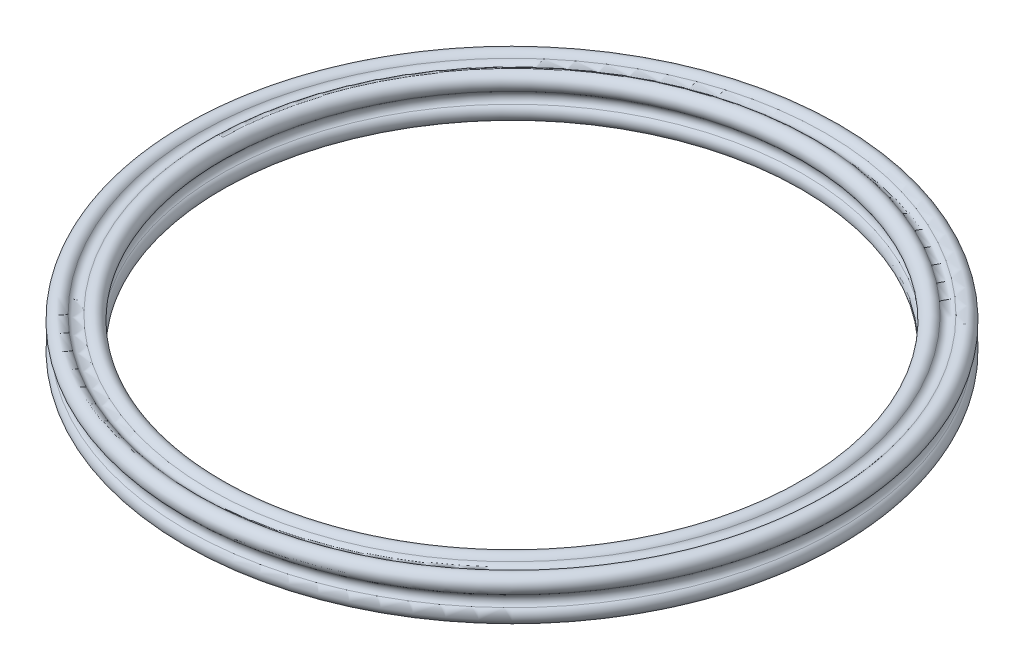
ISO-10303-21;
HEADER;
FILE_DESCRIPTION(('STEP AP214'),'2;1');
FILE_NAME('part.step','',(''),(''),'','','');
FILE_SCHEMA(('AUTOMOTIVE_DESIGN { 1 0 10303 214 1 1 1 1 }'));
ENDSEC;
DATA;
#1=APPLICATION_CONTEXT('core data for automotive mechanical design processes');
#2=APPLICATION_PROTOCOL_DEFINITION('international standard','automotive_design',2000,#1);
#3=PRODUCT_CONTEXT('',#1,'mechanical');
#4=PRODUCT('Part','Part','',(#3));
#5=PRODUCT_RELATED_PRODUCT_CATEGORY('part','',(#4));
#6=PRODUCT_DEFINITION_FORMATION('','',#4);
#7=PRODUCT_DEFINITION_CONTEXT('part definition',#1,'design');
#8=PRODUCT_DEFINITION('design','',#6,#7);
#9=PRODUCT_DEFINITION_SHAPE('','',#8);
#10=(LENGTH_UNIT() NAMED_UNIT(*) SI_UNIT(.MILLI.,.METRE.));
#11=(NAMED_UNIT(*) PLANE_ANGLE_UNIT() SI_UNIT($,.RADIAN.));
#12=(NAMED_UNIT(*) SI_UNIT($,.STERADIAN.) SOLID_ANGLE_UNIT());
#13=UNCERTAINTY_MEASURE_WITH_UNIT(LENGTH_MEASURE(1.E-05),#10,'distance_accuracy_value','');
#14=(GEOMETRIC_REPRESENTATION_CONTEXT(3) GLOBAL_UNCERTAINTY_ASSIGNED_CONTEXT((#13)) GLOBAL_UNIT_ASSIGNED_CONTEXT((#10,
#11,#12)) REPRESENTATION_CONTEXT('',''));
#15=CARTESIAN_POINT('',(0.,0.,0.));
#16=DIRECTION('',(0.,0.,1.));
#17=DIRECTION('',(1.,0.,0.));
#18=AXIS2_PLACEMENT_3D('',#15,#16,#17);
#19=CARTESIAN_POINT('',(0.,4.96653645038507,0.));
#20=DIRECTION('',(0.,-1.,0.));
#21=DIRECTION('',(0.,0.,-1.));
#22=AXIS2_PLACEMENT_3D('',#19,#20,#21);
#23=TOROIDAL_SURFACE('',#22,35.55,0.799999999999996);
#24=CARTESIAN_POINT('',(0.,4.49252025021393,0.));
#25=DIRECTION('',(0.,-1.,0.));
#26=DIRECTION('',(0.,0.,-1.));
#27=AXIS2_PLACEMENT_3D('',#24,#25,#26);
#28=CIRCLE('',#27,36.1944444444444);
#29=CARTESIAN_POINT('',(0.,4.49252025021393,-36.1944444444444));
#30=VERTEX_POINT('',#29);
#31=EDGE_CURVE('E10',#30,#30,#28,.T.);
#32=ORIENTED_EDGE('',*,*,#31,.F.);
#33=EDGE_LOOP('',(#32));
#34=FACE_BOUND('',#33,.T.);
#35=CARTESIAN_POINT('',(0.,4.49252025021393,0.));
#36=DIRECTION('',(0.,-1.,0.));
#37=DIRECTION('',(0.,0.,-1.));
#38=AXIS2_PLACEMENT_3D('',#35,#36,#37);
#39=CIRCLE('',#38,34.9055555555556);
#40=CARTESIAN_POINT('',(0.,4.49252025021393,-34.9055555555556));
#41=VERTEX_POINT('',#40);
#42=EDGE_CURVE('E57',#41,#41,#39,.T.);
#43=ORIENTED_EDGE('',*,*,#42,.T.);
#44=EDGE_LOOP('',(#43));
#45=FACE_BOUND('',#44,.T.);
#46=ADVANCED_FACE('F29',(#34,#45),#23,.F.);
#47=CARTESIAN_POINT('',(0.,3.9,0.));
#48=DIRECTION('',(0.,-1.,0.));
#49=DIRECTION('',(0.,0.,-1.));
#50=AXIS2_PLACEMENT_3D('',#47,#48,#49);
#51=TOROIDAL_SURFACE('',#50,37.,0.999999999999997);
#52=CARTESIAN_POINT('',(0.,3.09444444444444,0.));
#53=DIRECTION('',(0.,-1.,0.));
#54=DIRECTION('',(0.,0.,-1.));
#55=AXIS2_PLACEMENT_3D('',#52,#53,#54);
#56=CIRCLE('',#55,37.5925202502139);
#57=CARTESIAN_POINT('',(0.,3.09444444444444,-37.5925202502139));
#58=VERTEX_POINT('',#57);
#59=EDGE_CURVE('E35',#58,#58,#56,.T.);
#60=ORIENTED_EDGE('',*,*,#59,.F.);
#61=EDGE_LOOP('',(#60));
#62=FACE_BOUND('',#61,.T.);
#63=ORIENTED_EDGE('',*,*,#31,.T.);
#64=EDGE_LOOP('',(#63));
#65=FACE_BOUND('',#64,.T.);
#66=ADVANCED_FACE('F94',(#62,#65),#51,.T.);
#67=CARTESIAN_POINT('',(0.,2.45,0.));
#68=DIRECTION('',(0.,-1.,0.));
#69=DIRECTION('',(0.,0.,-1.));
#70=AXIS2_PLACEMENT_3D('',#67,#68,#69);
#71=TOROIDAL_SURFACE('',#70,38.0665364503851,0.799999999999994);
#72=CARTESIAN_POINT('',(0.,1.80555555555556,0.));
#73=DIRECTION('',(0.,-1.,0.));
#74=DIRECTION('',(0.,0.,-1.));
#75=AXIS2_PLACEMENT_3D('',#72,#73,#74);
#76=CIRCLE('',#75,37.5925202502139);
#77=CARTESIAN_POINT('',(0.,1.80555555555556,-37.5925202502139));
#78=VERTEX_POINT('',#77);
#79=EDGE_CURVE('E39',#78,#78,#76,.T.);
#80=ORIENTED_EDGE('',*,*,#79,.F.);
#81=EDGE_LOOP('',(#80));
#82=FACE_BOUND('',#81,.T.);
#83=ORIENTED_EDGE('',*,*,#59,.T.);
#84=EDGE_LOOP('',(#83));
#85=FACE_BOUND('',#84,.T.);
#86=ADVANCED_FACE('F89',(#82,#85),#71,.F.);
#87=CARTESIAN_POINT('',(0.,0.999999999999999,0.));
#88=DIRECTION('',(0.,-1.,0.));
#89=DIRECTION('',(0.,0.,-1.));
#90=AXIS2_PLACEMENT_3D('',#87,#88,#89);
#91=TOROIDAL_SURFACE('',#90,37.,0.999999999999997);
#92=CARTESIAN_POINT('',(0.,0.407479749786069,0.));
#93=DIRECTION('',(0.,-1.,0.));
#94=DIRECTION('',(0.,0.,-1.));
#95=AXIS2_PLACEMENT_3D('',#92,#93,#94);
#96=CIRCLE('',#95,36.1944444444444);
#97=CARTESIAN_POINT('',(0.,0.407479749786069,-36.1944444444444));
#98=VERTEX_POINT('',#97);
#99=EDGE_CURVE('E43',#98,#98,#96,.T.);
#100=ORIENTED_EDGE('',*,*,#99,.F.);
#101=EDGE_LOOP('',(#100));
#102=FACE_BOUND('',#101,.T.);
#103=ORIENTED_EDGE('',*,*,#79,.T.);
#104=EDGE_LOOP('',(#103));
#105=FACE_BOUND('',#104,.T.);
#106=ADVANCED_FACE('F83',(#102,#105),#91,.T.);
#107=CARTESIAN_POINT('',(0.,-0.0665364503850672,0.));
#108=DIRECTION('',(0.,-1.,0.));
#109=DIRECTION('',(0.,0.,-1.));
#110=AXIS2_PLACEMENT_3D('',#107,#108,#109);
#111=TOROIDAL_SURFACE('',#110,35.55,0.799999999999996);
#112=CARTESIAN_POINT('',(0.,0.407479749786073,0.));
#113=DIRECTION('',(0.,-1.,0.));
#114=DIRECTION('',(0.,0.,-1.));
#115=AXIS2_PLACEMENT_3D('',#112,#113,#114);
#116=CIRCLE('',#115,34.9055555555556);
#117=CARTESIAN_POINT('',(0.,0.407479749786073,-34.9055555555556));
#118=VERTEX_POINT('',#117);
#119=EDGE_CURVE('E48',#118,#118,#116,.T.);
#120=ORIENTED_EDGE('',*,*,#119,.F.);
#121=EDGE_LOOP('',(#120));
#122=FACE_BOUND('',#121,.T.);
#123=ORIENTED_EDGE('',*,*,#99,.T.);
#124=EDGE_LOOP('',(#123));
#125=FACE_BOUND('',#124,.T.);
#126=ADVANCED_FACE('F77',(#122,#125),#111,.F.);
#127=CARTESIAN_POINT('',(0.,0.999999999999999,0.));
#128=DIRECTION('',(0.,-1.,0.));
#129=DIRECTION('',(0.,0.,-1.));
#130=AXIS2_PLACEMENT_3D('',#127,#128,#129);
#131=TOROIDAL_SURFACE('',#130,34.1,0.999999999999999);
#132=CARTESIAN_POINT('',(0.,1.80555555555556,0.));
#133=DIRECTION('',(0.,-1.,0.));
#134=DIRECTION('',(0.,0.,-1.));
#135=AXIS2_PLACEMENT_3D('',#132,#133,#134);
#136=CIRCLE('',#135,33.5074797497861);
#137=CARTESIAN_POINT('',(0.,1.80555555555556,-33.5074797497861));
#138=VERTEX_POINT('',#137);
#139=EDGE_CURVE('E51',#138,#138,#136,.T.);
#140=ORIENTED_EDGE('',*,*,#139,.F.);
#141=EDGE_LOOP('',(#140));
#142=FACE_BOUND('',#141,.T.);
#143=ORIENTED_EDGE('',*,*,#119,.T.);
#144=EDGE_LOOP('',(#143));
#145=FACE_BOUND('',#144,.T.);
#146=ADVANCED_FACE('F71',(#142,#145),#131,.T.);
#147=CARTESIAN_POINT('',(0.,2.45,0.));
#148=DIRECTION('',(0.,-1.,0.));
#149=DIRECTION('',(0.,0.,-1.));
#150=AXIS2_PLACEMENT_3D('',#147,#148,#149);
#151=TOROIDAL_SURFACE('',#150,33.0334635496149,0.799999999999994);
#152=CARTESIAN_POINT('',(0.,3.09444444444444,0.));
#153=DIRECTION('',(0.,-1.,0.));
#154=DIRECTION('',(0.,0.,-1.));
#155=AXIS2_PLACEMENT_3D('',#152,#153,#154);
#156=CIRCLE('',#155,33.5074797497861);
#157=CARTESIAN_POINT('',(0.,3.09444444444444,-33.5074797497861));
#158=VERTEX_POINT('',#157);
#159=EDGE_CURVE('E54',#158,#158,#156,.T.);
#160=ORIENTED_EDGE('',*,*,#159,.F.);
#161=EDGE_LOOP('',(#160));
#162=FACE_BOUND('',#161,.T.);
#163=ORIENTED_EDGE('',*,*,#139,.T.);
#164=EDGE_LOOP('',(#163));
#165=FACE_BOUND('',#164,.T.);
#166=ADVANCED_FACE('F65',(#162,#165),#151,.F.);
#167=CARTESIAN_POINT('',(0.,3.9,0.));
#168=DIRECTION('',(0.,-1.,0.));
#169=DIRECTION('',(0.,0.,-1.));
#170=AXIS2_PLACEMENT_3D('',#167,#168,#169);
#171=TOROIDAL_SURFACE('',#170,34.1,1.);
#172=ORIENTED_EDGE('',*,*,#42,.F.);
#173=EDGE_LOOP('',(#172));
#174=FACE_BOUND('',#173,.T.);
#175=ORIENTED_EDGE('',*,*,#159,.T.);
#176=EDGE_LOOP('',(#175));
#177=FACE_BOUND('',#176,.T.);
#178=ADVANCED_FACE('F62',(#174,#177),#171,.T.);
#179=CLOSED_SHELL('',(#46,#66,#86,#106,#126,#146,#166,#178));
#180=MANIFOLD_SOLID_BREP('B2',#179);
#181=ADVANCED_BREP_SHAPE_REPRESENTATION('',(#18,#180),#14);
#182=SHAPE_DEFINITION_REPRESENTATION(#9,#181);
ENDSEC;
END-ISO-10303-21;
